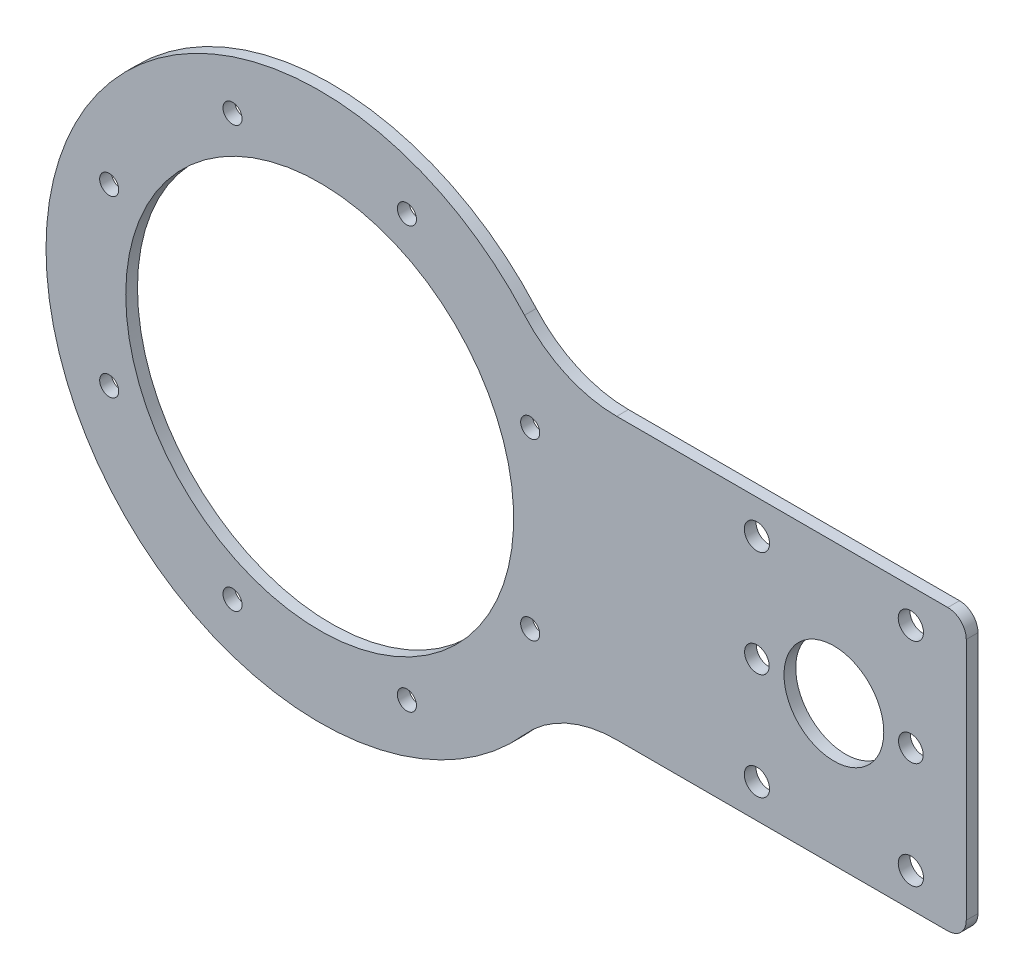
from build123d import *

# Parameters (mm, degrees)
SKETCH1_R           = 31.5
SKETCH1_R_2         = 1.55
SKETCH1_R_3         = 2.05
BOSS_EXTRUDE1_DEPTH = 1.905
FILLET1_R           = 20
FILLET2_R           = 3
SKETCH2_R           = 2
CUT_EXTRUDE1_DEPTH  = 115.036974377
SKETCH3_R           = 8.1
CUT_EXTRUDE2_DEPTH  = 115.036974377


with BuildPart() as part:
    # Sketch1 → Boss-Extrude1 (new body)
    with BuildSketch(Plane(origin=(0, 0, 0), x_dir=(0, 1, 0), z_dir=(0, 0, 1))):
        with BuildLine():
            Line((-22.75, -38.186908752), (-22.75, -105))
            Line((-22.75, -105), (22.75, -105))
            Line((22.75, -105), (22.75, -38.186908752))
            ThreePointArc((22.75, -38.186908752), (0, 44.45), (-22.75, -38.186908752))
        make_face()
        with Locations(Location((0, 0, 0), (0, 0, 90))):
            Circle(SKETCH1_R, mode=Mode.SUBTRACT)
        with Locations(Location((-34.183542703, 14.159286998, 0), (0, 0, 90))):
            Circle(SKETCH1_R_2, mode=Mode.SUBTRACT)
        with Locations(Location((-14.159286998, 34.183542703, 0), (0, 0, 90))):
            Circle(SKETCH1_R_2, mode=Mode.SUBTRACT)
        with Locations(Location((14.159286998, 34.183542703, 0), (0, 0, 90))):
            Circle(SKETCH1_R_2, mode=Mode.SUBTRACT)
        with Locations(Location((34.183542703, 14.159286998, 0), (0, 0, 90))):
            Circle(SKETCH1_R_2, mode=Mode.SUBTRACT)
        with Locations(Location((34.183542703, -14.159286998, 0), (0, 0, 90))):
            Circle(SKETCH1_R_2, mode=Mode.SUBTRACT)
        with Locations(Location((14.159286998, -34.183542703, 0), (0, 0, 90))):
            Circle(SKETCH1_R_2, mode=Mode.SUBTRACT)
        with Locations(Location((-14.159286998, -34.183542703, 0), (0, 0, 90))):
            Circle(SKETCH1_R_2, mode=Mode.SUBTRACT)
        with Locations(Location((-34.183542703, -14.159286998, 0), (0, 0, 90))):
            Circle(SKETCH1_R_2, mode=Mode.SUBTRACT)
        with Locations(Location((-17.25, -96, 0), (0, 0, 90))):
            Circle(SKETCH1_R_3, mode=Mode.SUBTRACT)
        with Locations(Location((17.25, -96, 0), (0, 0, 90))):
            Circle(SKETCH1_R_3, mode=Mode.SUBTRACT)
        with Locations(Location((-17.25, -71, 0), (0, 0, 90))):
            Circle(SKETCH1_R_3, mode=Mode.SUBTRACT)
        with Locations(Location((17.25, -71, 0), (0, 0, 90))):
            Circle(SKETCH1_R_3, mode=Mode.SUBTRACT)
    extrude(amount=BOSS_EXTRUDE1_DEPTH)

    # Fillet1
    fillet1_edges = [part.edges().sort_by_distance(p)[0] for p in [
        (38.186908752, -22.75, 0.9525),
        (38.186908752, 22.75, 0.9525),
    ]]
    fillet(fillet1_edges, radius=FILLET1_R)

    # Fillet2
    fillet2_edges = [part.edges().sort_by_distance(p)[0] for p in [
        (105, 22.75, 0.9525),
        (105, -22.75, 0.9525),
    ]]
    fillet(fillet2_edges, radius=FILLET2_R)

    # Sketch2 → Cut-Extrude1 (cut, through all)
    with BuildSketch(Plane.XY.offset(1.905)):
        with Locations((71, 0)):
            Circle(SKETCH2_R)
        with Locations((96, 0)):
            Circle(SKETCH2_R)
    extrude(amount=-CUT_EXTRUDE1_DEPTH, mode=Mode.SUBTRACT)

    # Sketch3 → Cut-Extrude2 (cut, through all)
    with BuildSketch(Plane.XY.offset(1.905)):
        with Locations((83.5, 0)):
            Circle(SKETCH3_R)
    extrude(amount=-CUT_EXTRUDE2_DEPTH, mode=Mode.SUBTRACT)


solid = part.part
